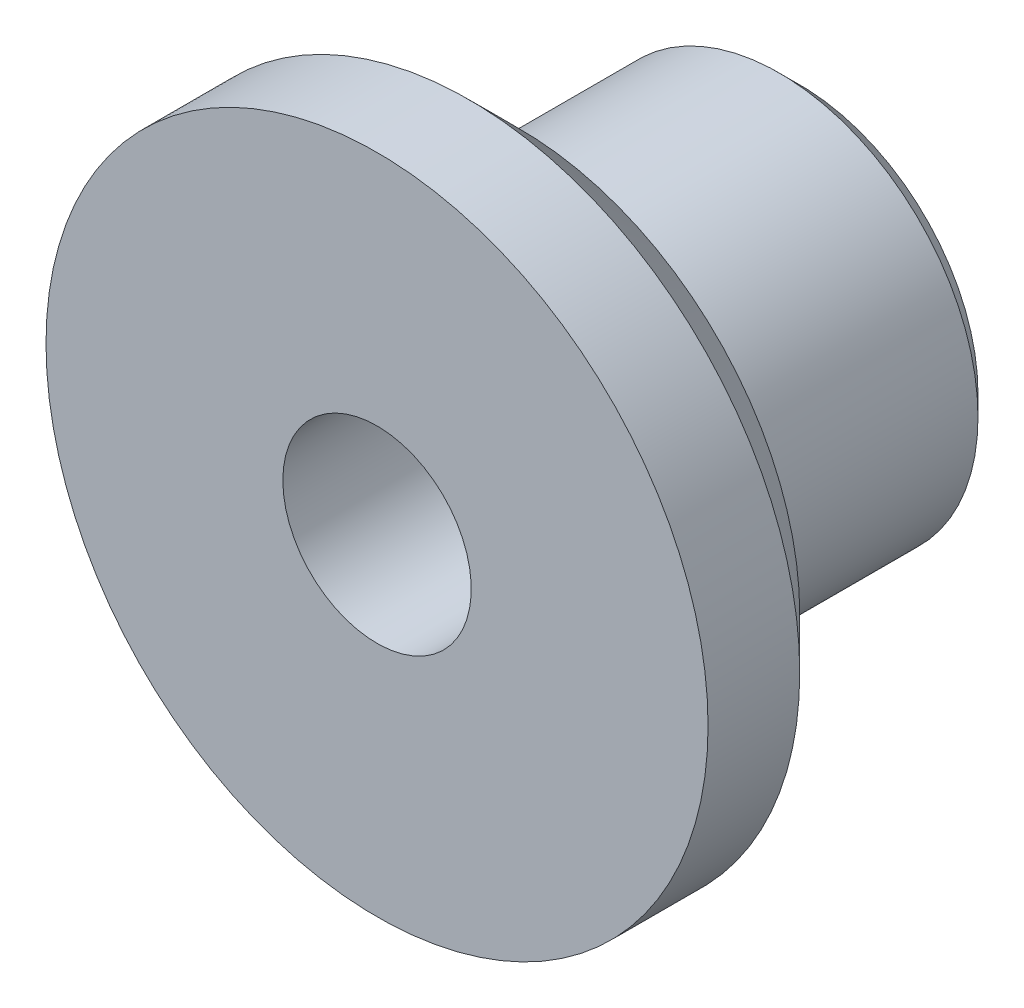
ISO-10303-21;
HEADER;
FILE_DESCRIPTION(('STEP AP214'),'2;1');
FILE_NAME('part.step','',(''),(''),'','','');
FILE_SCHEMA(('AUTOMOTIVE_DESIGN { 1 0 10303 214 1 1 1 1 }'));
ENDSEC;
DATA;
#1=APPLICATION_CONTEXT('core data for automotive mechanical design processes');
#2=APPLICATION_PROTOCOL_DEFINITION('international standard','automotive_design',2000,#1);
#3=PRODUCT_CONTEXT('',#1,'mechanical');
#4=PRODUCT('Part','Part','',(#3));
#5=PRODUCT_RELATED_PRODUCT_CATEGORY('part','',(#4));
#6=PRODUCT_DEFINITION_FORMATION('','',#4);
#7=PRODUCT_DEFINITION_CONTEXT('part definition',#1,'design');
#8=PRODUCT_DEFINITION('design','',#6,#7);
#9=PRODUCT_DEFINITION_SHAPE('','',#8);
#10=(LENGTH_UNIT() NAMED_UNIT(*) SI_UNIT(.MILLI.,.METRE.));
#11=(NAMED_UNIT(*) PLANE_ANGLE_UNIT() SI_UNIT($,.RADIAN.));
#12=(NAMED_UNIT(*) SI_UNIT($,.STERADIAN.) SOLID_ANGLE_UNIT());
#13=UNCERTAINTY_MEASURE_WITH_UNIT(LENGTH_MEASURE(1.E-05),#10,'distance_accuracy_value','');
#14=(GEOMETRIC_REPRESENTATION_CONTEXT(3) GLOBAL_UNCERTAINTY_ASSIGNED_CONTEXT((#13)) GLOBAL_UNIT_ASSIGNED_CONTEXT((#10,
#11,#12)) REPRESENTATION_CONTEXT('',''));
#15=CARTESIAN_POINT('',(0.,0.,0.));
#16=DIRECTION('',(0.,0.,1.));
#17=DIRECTION('',(1.,0.,0.));
#18=AXIS2_PLACEMENT_3D('',#15,#16,#17);
#19=CARTESIAN_POINT('',(0.,0.,8.3));
#20=DIRECTION('',(0.,0.,-1.));
#21=DIRECTION('',(-1.,0.,0.));
#22=AXIS2_PLACEMENT_3D('',#19,#20,#21);
#23=CYLINDRICAL_SURFACE('',#22,3.9);
#24=CARTESIAN_POINT('',(0.,0.,5.30000000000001));
#25=DIRECTION('',(0.,0.,1.));
#26=DIRECTION('',(1.,0.,0.));
#27=AXIS2_PLACEMENT_3D('',#24,#25,#26);
#28=CIRCLE('',#27,3.9);
#29=CARTESIAN_POINT('',(-3.9,0.,5.30000000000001));
#30=VERTEX_POINT('',#29);
#31=EDGE_CURVE('E11',#30,#30,#28,.F.);
#32=CARTESIAN_POINT('',(0.,0.,0.400000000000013));
#33=DIRECTION('',(0.,0.,1.));
#34=DIRECTION('',(1.,0.,0.));
#35=AXIS2_PLACEMENT_3D('',#32,#33,#34);
#36=CIRCLE('',#35,3.9);
#37=CARTESIAN_POINT('',(-3.9,0.,0.400000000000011));
#38=VERTEX_POINT('',#37);
#39=EDGE_CURVE('E56',#38,#38,#36,.T.);
#40=CARTESIAN_POINT('',(-3.9,0.,5.30000000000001));
#41=CARTESIAN_POINT('',(-3.9,0.,5.24895833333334));
#42=CARTESIAN_POINT('',(-3.9,0.,5.19791666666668));
#43=CARTESIAN_POINT('',(-3.9,0.,5.09583333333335));
#44=CARTESIAN_POINT('',(-3.9,0.,5.04479166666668));
#45=CARTESIAN_POINT('',(-3.9,0.,4.94270833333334));
#46=CARTESIAN_POINT('',(-3.9,0.,4.89166666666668));
#47=CARTESIAN_POINT('',(-3.9,0.,4.78958333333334));
#48=CARTESIAN_POINT('',(-3.9,0.,4.73854166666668));
#49=CARTESIAN_POINT('',(-3.9,0.,4.63645833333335));
#50=CARTESIAN_POINT('',(-3.9,0.,4.58541666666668));
#51=CARTESIAN_POINT('',(-3.9,0.,4.48333333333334));
#52=CARTESIAN_POINT('',(-3.9,0.,4.43229166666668));
#53=CARTESIAN_POINT('',(-3.9,0.,4.33020833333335));
#54=CARTESIAN_POINT('',(-3.9,0.,4.27916666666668));
#55=CARTESIAN_POINT('',(-3.9,0.,4.17708333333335));
#56=CARTESIAN_POINT('',(-3.9,0.,4.12604166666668));
#57=CARTESIAN_POINT('',(-3.9,0.,4.02395833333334));
#58=CARTESIAN_POINT('',(-3.9,0.,3.97291666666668));
#59=CARTESIAN_POINT('',(-3.9,0.,3.87083333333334));
#60=CARTESIAN_POINT('',(-3.9,0.,3.81979166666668));
#61=CARTESIAN_POINT('',(-3.9,0.,3.71770833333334));
#62=CARTESIAN_POINT('',(-3.9,0.,3.66666666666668));
#63=CARTESIAN_POINT('',(-3.9,0.,3.56458333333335));
#64=CARTESIAN_POINT('',(-3.9,0.,3.51354166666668));
#65=CARTESIAN_POINT('',(-3.9,0.,3.41145833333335));
#66=CARTESIAN_POINT('',(-3.9,0.,3.36041666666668));
#67=CARTESIAN_POINT('',(-3.9,0.,3.25833333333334));
#68=CARTESIAN_POINT('',(-3.9,0.,3.20729166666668));
#69=CARTESIAN_POINT('',(-3.9,0.,3.10520833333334));
#70=CARTESIAN_POINT('',(-3.9,0.,3.05416666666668));
#71=CARTESIAN_POINT('',(-3.9,0.,2.95208333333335));
#72=CARTESIAN_POINT('',(-3.9,0.,2.90104166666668));
#73=CARTESIAN_POINT('',(-3.9,0.,2.79895833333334));
#74=CARTESIAN_POINT('',(-3.9,0.,2.74791666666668));
#75=CARTESIAN_POINT('',(-3.9,0.,2.64583333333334));
#76=CARTESIAN_POINT('',(-3.9,0.,2.59479166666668));
#77=CARTESIAN_POINT('',(-3.9,0.,2.49270833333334));
#78=CARTESIAN_POINT('',(-3.9,0.,2.44166666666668));
#79=CARTESIAN_POINT('',(-3.9,0.,2.33958333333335));
#80=CARTESIAN_POINT('',(-3.9,0.,2.28854166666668));
#81=CARTESIAN_POINT('',(-3.9,0.,2.18645833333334));
#82=CARTESIAN_POINT('',(-3.9,0.,2.13541666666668));
#83=CARTESIAN_POINT('',(-3.9,0.,2.03333333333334));
#84=CARTESIAN_POINT('',(-3.9,0.,1.98229166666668));
#85=CARTESIAN_POINT('',(-3.9,0.,1.88020833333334));
#86=CARTESIAN_POINT('',(-3.9,0.,1.82916666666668));
#87=CARTESIAN_POINT('',(-3.9,0.,1.72708333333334));
#88=CARTESIAN_POINT('',(-3.9,0.,1.67604166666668));
#89=CARTESIAN_POINT('',(-3.9,0.,1.57395833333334));
#90=CARTESIAN_POINT('',(-3.9,0.,1.52291666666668));
#91=CARTESIAN_POINT('',(-3.9,0.,1.42083333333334));
#92=CARTESIAN_POINT('',(-3.9,0.,1.36979166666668));
#93=CARTESIAN_POINT('',(-3.9,0.,1.26770833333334));
#94=CARTESIAN_POINT('',(-3.9,0.,1.21666666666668));
#95=CARTESIAN_POINT('',(-3.9,0.,1.11458333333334));
#96=CARTESIAN_POINT('',(-3.9,0.,1.06354166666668));
#97=CARTESIAN_POINT('',(-3.9,0.,0.961458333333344));
#98=CARTESIAN_POINT('',(-3.9,0.,0.910416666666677));
#99=CARTESIAN_POINT('',(-3.9,0.,0.808333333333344));
#100=CARTESIAN_POINT('',(-3.9,0.,0.757291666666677));
#101=CARTESIAN_POINT('',(-3.9,0.,0.655208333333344));
#102=CARTESIAN_POINT('',(-3.9,0.,0.604166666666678));
#103=CARTESIAN_POINT('',(-3.9,0.,0.502083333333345));
#104=CARTESIAN_POINT('',(-3.9,0.,0.451041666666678));
#105=CARTESIAN_POINT('',(-3.9,0.,0.400000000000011));
#106=B_SPLINE_CURVE_WITH_KNOTS('',3,(#40,#41,#42,#43,#44,#45,#46,#47,#48,#49,#50,#51,#52,#53,
#54,#55,#56,#57,#58,#59,#60,#61,#62,#63,#64,#65,#66,#67,#68,#69,#70,#71,#72,#73,#74,#75,#76,#77,
#78,#79,#80,#81,#82,#83,#84,#85,#86,#87,#88,#89,#90,#91,#92,#93,#94,#95,#96,#97,#98,#99,#100,
#101,#102,#103,#104,#105),.UNSPECIFIED.,.F.,.F.,(4,2,2,2,2,2,2,2,2,2,2,2,2,2,2,2,2,2,2,2,2,2,2,
2,2,2,2,2,2,2,2,2,4),(0.,0.153125,0.306249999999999,0.459375,0.6125,0.765625,0.918749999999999,
1.071875,1.225,1.378125,1.53125,1.684375,1.8375,1.990625,2.14375,2.296875,2.45,2.603125,2.75625,
2.909375,3.0625,3.215625,3.36875,3.521875,3.675,3.828125,3.98125,4.134375,4.2875,4.440625,
4.59375,4.746875,4.9),.UNSPECIFIED.);
#107=EDGE_CURVE('BSEAM33',#30,#38,#106,.T.);
#108=ORIENTED_EDGE('',*,*,#31,.T.);
#109=ORIENTED_EDGE('',*,*,#39,.T.);
#110=ORIENTED_EDGE('',*,*,#107,.T.);
#111=ORIENTED_EDGE('',*,*,#107,.F.);
#112=EDGE_LOOP('',(#108,#110,#109,#111));
#113=FACE_BOUND('',#112,.T.);
#114=ADVANCED_FACE('F33',(#113),#23,.T.);
#115=CARTESIAN_POINT('',(0.,0.,8.3));
#116=DIRECTION('',(0.,0.,-1.));
#117=DIRECTION('',(-1.,0.,0.));
#118=AXIS2_PLACEMENT_3D('',#115,#116,#117);
#119=CYLINDRICAL_SURFACE('',#118,1.85);
#120=CARTESIAN_POINT('',(0.,0.,0.400000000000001));
#121=DIRECTION('',(0.,0.,1.));
#122=DIRECTION('',(1.,0.,0.));
#123=AXIS2_PLACEMENT_3D('',#120,#121,#122);
#124=CIRCLE('',#123,1.85);
#125=CARTESIAN_POINT('',(-1.85,0.,0.400000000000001));
#126=VERTEX_POINT('',#125);
#127=EDGE_CURVE('E44',#126,#126,#124,.F.);
#128=CARTESIAN_POINT('',(0.,0.,8.3));
#129=DIRECTION('',(0.,0.,1.));
#130=DIRECTION('',(1.,0.,0.));
#131=AXIS2_PLACEMENT_3D('',#128,#129,#130);
#132=CIRCLE('',#131,1.85);
#133=CARTESIAN_POINT('',(-1.85,0.,8.3));
#134=VERTEX_POINT('',#133);
#135=EDGE_CURVE('E68',#134,#134,#132,.T.);
#136=CARTESIAN_POINT('',(-1.85,0.,0.400000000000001));
#137=CARTESIAN_POINT('',(-1.85,0.,0.482291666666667));
#138=CARTESIAN_POINT('',(-1.85,0.,0.564583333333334));
#139=CARTESIAN_POINT('',(-1.85,0.,0.729166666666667));
#140=CARTESIAN_POINT('',(-1.85,0.,0.811458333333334));
#141=CARTESIAN_POINT('',(-1.85,0.,0.976041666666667));
#142=CARTESIAN_POINT('',(-1.85,0.,1.05833333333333));
#143=CARTESIAN_POINT('',(-1.85,0.,1.22291666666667));
#144=CARTESIAN_POINT('',(-1.85,0.,1.30520833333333));
#145=CARTESIAN_POINT('',(-1.85,0.,1.46979166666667));
#146=CARTESIAN_POINT('',(-1.85,0.,1.55208333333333));
#147=CARTESIAN_POINT('',(-1.85,0.,1.71666666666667));
#148=CARTESIAN_POINT('',(-1.85,0.,1.79895833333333));
#149=CARTESIAN_POINT('',(-1.85,0.,1.96354166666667));
#150=CARTESIAN_POINT('',(-1.85,0.,2.04583333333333));
#151=CARTESIAN_POINT('',(-1.85,0.,2.21041666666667));
#152=CARTESIAN_POINT('',(-1.85,0.,2.29270833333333));
#153=CARTESIAN_POINT('',(-1.85,0.,2.45729166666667));
#154=CARTESIAN_POINT('',(-1.85,0.,2.53958333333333));
#155=CARTESIAN_POINT('',(-1.85,0.,2.70416666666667));
#156=CARTESIAN_POINT('',(-1.85,0.,2.78645833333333));
#157=CARTESIAN_POINT('',(-1.85,0.,2.95104166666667));
#158=CARTESIAN_POINT('',(-1.85,0.,3.03333333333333));
#159=CARTESIAN_POINT('',(-1.85,0.,3.19791666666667));
#160=CARTESIAN_POINT('',(-1.85,0.,3.28020833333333));
#161=CARTESIAN_POINT('',(-1.85,0.,3.44479166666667));
#162=CARTESIAN_POINT('',(-1.85,0.,3.52708333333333));
#163=CARTESIAN_POINT('',(-1.85,0.,3.69166666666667));
#164=CARTESIAN_POINT('',(-1.85,0.,3.77395833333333));
#165=CARTESIAN_POINT('',(-1.85,0.,3.93854166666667));
#166=CARTESIAN_POINT('',(-1.85,0.,4.02083333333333));
#167=CARTESIAN_POINT('',(-1.85,0.,4.18541666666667));
#168=CARTESIAN_POINT('',(-1.85,0.,4.26770833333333));
#169=CARTESIAN_POINT('',(-1.85,0.,4.43229166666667));
#170=CARTESIAN_POINT('',(-1.85,0.,4.51458333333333));
#171=CARTESIAN_POINT('',(-1.85,0.,4.67916666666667));
#172=CARTESIAN_POINT('',(-1.85,0.,4.76145833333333));
#173=CARTESIAN_POINT('',(-1.85,0.,4.92604166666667));
#174=CARTESIAN_POINT('',(-1.85,0.,5.00833333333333));
#175=CARTESIAN_POINT('',(-1.85,0.,5.17291666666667));
#176=CARTESIAN_POINT('',(-1.85,0.,5.25520833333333));
#177=CARTESIAN_POINT('',(-1.85,0.,5.41979166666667));
#178=CARTESIAN_POINT('',(-1.85,0.,5.50208333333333));
#179=CARTESIAN_POINT('',(-1.85,0.,5.66666666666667));
#180=CARTESIAN_POINT('',(-1.85,0.,5.74895833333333));
#181=CARTESIAN_POINT('',(-1.85,0.,5.91354166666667));
#182=CARTESIAN_POINT('',(-1.85,0.,5.99583333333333));
#183=CARTESIAN_POINT('',(-1.85,0.,6.16041666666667));
#184=CARTESIAN_POINT('',(-1.85,0.,6.24270833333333));
#185=CARTESIAN_POINT('',(-1.85,0.,6.40729166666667));
#186=CARTESIAN_POINT('',(-1.85,0.,6.48958333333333));
#187=CARTESIAN_POINT('',(-1.85,0.,6.65416666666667));
#188=CARTESIAN_POINT('',(-1.85,0.,6.73645833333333));
#189=CARTESIAN_POINT('',(-1.85,0.,6.90104166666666));
#190=CARTESIAN_POINT('',(-1.85,0.,6.98333333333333));
#191=CARTESIAN_POINT('',(-1.85,0.,7.14791666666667));
#192=CARTESIAN_POINT('',(-1.85,0.,7.23020833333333));
#193=CARTESIAN_POINT('',(-1.85,0.,7.39479166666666));
#194=CARTESIAN_POINT('',(-1.85,0.,7.47708333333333));
#195=CARTESIAN_POINT('',(-1.85,0.,7.64166666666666));
#196=CARTESIAN_POINT('',(-1.85,0.,7.72395833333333));
#197=CARTESIAN_POINT('',(-1.85,0.,7.88854166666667));
#198=CARTESIAN_POINT('',(-1.85,0.,7.97083333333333));
#199=CARTESIAN_POINT('',(-1.85,0.,8.13541666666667));
#200=CARTESIAN_POINT('',(-1.85,0.,8.21770833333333));
#201=CARTESIAN_POINT('',(-1.85,0.,8.3));
#202=B_SPLINE_CURVE_WITH_KNOTS('',3,(#136,#137,#138,#139,#140,#141,#142,#143,#144,#145,#146,
#147,#148,#149,#150,#151,#152,#153,#154,#155,#156,#157,#158,#159,#160,#161,#162,#163,#164,#165,
#166,#167,#168,#169,#170,#171,#172,#173,#174,#175,#176,#177,#178,#179,#180,#181,#182,#183,#184,
#185,#186,#187,#188,#189,#190,#191,#192,#193,#194,#195,#196,#197,#198,#199,#200,#201),
.UNSPECIFIED.,.F.,.F.,(4,2,2,2,2,2,2,2,2,2,2,2,2,2,2,2,2,2,2,2,2,2,2,2,2,2,2,2,2,2,2,2,4),(0.,
0.246874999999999,0.493749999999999,0.740624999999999,0.987499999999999,1.234375,1.48125,
1.728125,1.975,2.221875,2.46875,2.715625,2.9625,3.209375,3.45625,3.703125,3.95,4.196875,4.44375,
4.690625,4.9375,5.184375,5.43125,5.678125,5.925,6.171875,6.41875,6.665625,6.9125,7.159375,
7.40625,7.653125,7.9),.UNSPECIFIED.);
#203=EDGE_CURVE('BSEAM72',#126,#134,#202,.T.);
#204=ORIENTED_EDGE('',*,*,#127,.T.);
#205=ORIENTED_EDGE('',*,*,#135,.T.);
#206=ORIENTED_EDGE('',*,*,#203,.T.);
#207=ORIENTED_EDGE('',*,*,#203,.F.);
#208=EDGE_LOOP('',(#204,#206,#205,#207));
#209=FACE_BOUND('',#208,.T.);
#210=ADVANCED_FACE('F72',(#209),#119,.F.);
#211=CARTESIAN_POINT('',(0.,0.,0.));
#212=DIRECTION('',(0.,0.,1.));
#213=DIRECTION('',(1.,0.,0.));
#214=AXIS2_PLACEMENT_3D('',#211,#212,#213);
#215=PLANE('',#214);
#216=CARTESIAN_POINT('',(0.,0.,0.));
#217=DIRECTION('',(0.,0.,1.));
#218=DIRECTION('',(1.,0.,0.));
#219=AXIS2_PLACEMENT_3D('',#216,#217,#218);
#220=CIRCLE('',#219,3.49999999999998);
#221=CARTESIAN_POINT('',(3.49999999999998,0.,0.));
#222=VERTEX_POINT('',#221);
#223=EDGE_CURVE('E48',#222,#222,#220,.F.);
#224=ORIENTED_EDGE('',*,*,#223,.T.);
#225=EDGE_LOOP('',(#224));
#226=FACE_BOUND('',#225,.T.);
#227=CARTESIAN_POINT('',(0.,0.,0.));
#228=DIRECTION('',(0.,0.,1.));
#229=DIRECTION('',(1.,0.,0.));
#230=AXIS2_PLACEMENT_3D('',#227,#228,#229);
#231=CIRCLE('',#230,2.25);
#232=CARTESIAN_POINT('',(-2.25,0.,0.));
#233=VERTEX_POINT('',#232);
#234=EDGE_CURVE('E53',#233,#233,#231,.T.);
#235=ORIENTED_EDGE('',*,*,#234,.T.);
#236=EDGE_LOOP('',(#235));
#237=FACE_BOUND('',#236,.T.);
#238=ADVANCED_FACE('F89',(#226,#237),#215,.F.);
#239=CARTESIAN_POINT('',(0.,0.,5.5));
#240=DIRECTION('',(0.,0.,1.));
#241=DIRECTION('',(1.,0.,0.));
#242=AXIS2_PLACEMENT_3D('',#239,#240,#241);
#243=PLANE('',#242);
#244=CARTESIAN_POINT('',(0.,0.,5.5));
#245=DIRECTION('',(0.,0.,1.));
#246=DIRECTION('',(1.,0.,0.));
#247=AXIS2_PLACEMENT_3D('',#244,#245,#246);
#248=CIRCLE('',#247,4.09999999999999);
#249=CARTESIAN_POINT('',(4.09999999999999,0.,5.5));
#250=VERTEX_POINT('',#249);
#251=EDGE_CURVE('E40',#250,#250,#248,.T.);
#252=ORIENTED_EDGE('',*,*,#251,.T.);
#253=EDGE_LOOP('',(#252));
#254=FACE_BOUND('',#253,.T.);
#255=CARTESIAN_POINT('',(0.,0.,5.5));
#256=DIRECTION('',(0.,0.,1.));
#257=DIRECTION('',(1.,0.,0.));
#258=AXIS2_PLACEMENT_3D('',#255,#256,#257);
#259=CIRCLE('',#258,5.50000000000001);
#260=CARTESIAN_POINT('',(5.50000000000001,0.,5.5));
#261=VERTEX_POINT('',#260);
#262=EDGE_CURVE('E62',#261,#261,#259,.F.);
#263=ORIENTED_EDGE('',*,*,#262,.T.);
#264=EDGE_LOOP('',(#263));
#265=FACE_BOUND('',#264,.T.);
#266=ADVANCED_FACE('F83',(#254,#265),#243,.F.);
#267=CARTESIAN_POINT('',(0.,0.,-18.3847763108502));
#268=DIRECTION('',(0.,0.,1.));
#269=DIRECTION('',(1.,0.,0.));
#270=AXIS2_PLACEMENT_3D('',#267,#268,#269);
#271=CYLINDRICAL_SURFACE('',#270,6.5);
#272=CARTESIAN_POINT('',(0.,0.,6.5));
#273=DIRECTION('',(0.,0.,1.));
#274=DIRECTION('',(1.,0.,0.));
#275=AXIS2_PLACEMENT_3D('',#272,#273,#274);
#276=CIRCLE('',#275,6.5);
#277=CARTESIAN_POINT('',(6.5,0.,6.5));
#278=VERTEX_POINT('',#277);
#279=EDGE_CURVE('E59',#278,#278,#276,.T.);
#280=ORIENTED_EDGE('',*,*,#279,.T.);
#281=EDGE_LOOP('',(#280));
#282=FACE_BOUND('',#281,.T.);
#283=CARTESIAN_POINT('',(0.,0.,8.3));
#284=DIRECTION('',(0.,0.,1.));
#285=DIRECTION('',(1.,0.,0.));
#286=AXIS2_PLACEMENT_3D('',#283,#284,#285);
#287=CIRCLE('',#286,6.5);
#288=CARTESIAN_POINT('',(6.5,0.,8.3));
#289=VERTEX_POINT('',#288);
#290=EDGE_CURVE('E65',#289,#289,#287,.T.);
#291=ORIENTED_EDGE('',*,*,#290,.F.);
#292=EDGE_LOOP('',(#291));
#293=FACE_BOUND('',#292,.T.);
#294=ADVANCED_FACE('F78',(#282,#293),#271,.T.);
#295=CARTESIAN_POINT('',(0.,0.,8.3));
#296=DIRECTION('',(0.,0.,1.));
#297=DIRECTION('',(1.,0.,0.));
#298=AXIS2_PLACEMENT_3D('',#295,#296,#297);
#299=PLANE('',#298);
#300=ORIENTED_EDGE('',*,*,#135,.F.);
#301=EDGE_LOOP('',(#300));
#302=FACE_BOUND('',#301,.T.);
#303=ORIENTED_EDGE('',*,*,#290,.T.);
#304=EDGE_LOOP('',(#303));
#305=FACE_BOUND('',#304,.T.);
#306=ADVANCED_FACE('F74',(#302,#305),#299,.T.);
#307=CARTESIAN_POINT('',(0.,0.,5.5));
#308=DIRECTION('',(0.,0.,1.));
#309=DIRECTION('',(1.,0.,0.));
#310=AXIS2_PLACEMENT_3D('',#307,#308,#309);
#311=CONICAL_SURFACE('',#310,5.50000000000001,0.785398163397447);
#312=ORIENTED_EDGE('',*,*,#279,.F.);
#313=EDGE_LOOP('',(#312));
#314=FACE_BOUND('',#313,.T.);
#315=ORIENTED_EDGE('',*,*,#262,.F.);
#316=EDGE_LOOP('',(#315));
#317=FACE_BOUND('',#316,.T.);
#318=ADVANCED_FACE('F77',(#314,#317),#311,.T.);
#319=CARTESIAN_POINT('',(0.,0.,0.400000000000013));
#320=DIRECTION('',(0.,0.,1.));
#321=DIRECTION('',(1.,0.,0.));
#322=AXIS2_PLACEMENT_3D('',#319,#320,#321);
#323=CONICAL_SURFACE('',#322,3.9,0.78539816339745);
#324=ORIENTED_EDGE('',*,*,#223,.F.);
#325=EDGE_LOOP('',(#324));
#326=FACE_BOUND('',#325,.T.);
#327=ORIENTED_EDGE('',*,*,#39,.F.);
#328=EDGE_LOOP('',(#327));
#329=FACE_BOUND('',#328,.T.);
#330=ADVANCED_FACE('F103',(#326,#329),#323,.T.);
#331=CARTESIAN_POINT('',(0.,0.,0.));
#332=DIRECTION('',(0.,0.,-1.));
#333=DIRECTION('',(-1.,0.,0.));
#334=AXIS2_PLACEMENT_3D('',#331,#332,#333);
#335=CONICAL_SURFACE('',#334,2.25,0.785398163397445);
#336=CARTESIAN_POINT('',(-1.85,0.,0.400000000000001));
#337=CARTESIAN_POINT('',(-1.85416666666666,0.,0.395833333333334));
#338=CARTESIAN_POINT('',(-1.85833333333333,0.,0.391666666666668));
#339=CARTESIAN_POINT('',(-1.86666666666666,0.,0.383333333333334));
#340=CARTESIAN_POINT('',(-1.87083333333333,0.,0.379166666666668));
#341=CARTESIAN_POINT('',(-1.87916666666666,0.,0.370833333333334));
#342=CARTESIAN_POINT('',(-1.88333333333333,0.,0.366666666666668));
#343=CARTESIAN_POINT('',(-1.89166666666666,0.,0.358333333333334));
#344=CARTESIAN_POINT('',(-1.89583333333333,0.,0.354166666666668));
#345=CARTESIAN_POINT('',(-1.90416666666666,0.,0.345833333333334));
#346=CARTESIAN_POINT('',(-1.90833333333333,0.,0.341666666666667));
#347=CARTESIAN_POINT('',(-1.91666666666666,0.,0.333333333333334));
#348=CARTESIAN_POINT('',(-1.92083333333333,0.,0.329166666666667));
#349=CARTESIAN_POINT('',(-1.92916666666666,0.,0.320833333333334));
#350=CARTESIAN_POINT('',(-1.93333333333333,0.,0.316666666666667));
#351=CARTESIAN_POINT('',(-1.94166666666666,0.,0.308333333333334));
#352=CARTESIAN_POINT('',(-1.94583333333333,0.,0.304166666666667));
#353=CARTESIAN_POINT('',(-1.95416666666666,0.,0.295833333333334));
#354=CARTESIAN_POINT('',(-1.95833333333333,0.,0.291666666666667));
#355=CARTESIAN_POINT('',(-1.96666666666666,0.,0.283333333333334));
#356=CARTESIAN_POINT('',(-1.97083333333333,0.,0.279166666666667));
#357=CARTESIAN_POINT('',(-1.97916666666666,0.,0.270833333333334));
#358=CARTESIAN_POINT('',(-1.98333333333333,0.,0.266666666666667));
#359=CARTESIAN_POINT('',(-1.99166666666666,0.,0.258333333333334));
#360=CARTESIAN_POINT('',(-1.99583333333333,0.,0.254166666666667));
#361=CARTESIAN_POINT('',(-2.00416666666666,0.,0.245833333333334));
#362=CARTESIAN_POINT('',(-2.00833333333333,0.,0.241666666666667));
#363=CARTESIAN_POINT('',(-2.01666666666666,0.,0.233333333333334));
#364=CARTESIAN_POINT('',(-2.02083333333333,0.,0.229166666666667));
#365=CARTESIAN_POINT('',(-2.02916666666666,0.,0.220833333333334));
#366=CARTESIAN_POINT('',(-2.03333333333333,0.,0.216666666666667));
#367=CARTESIAN_POINT('',(-2.04166666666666,0.,0.208333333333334));
#368=CARTESIAN_POINT('',(-2.04583333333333,0.,0.204166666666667));
#369=CARTESIAN_POINT('',(-2.05416666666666,0.,0.195833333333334));
#370=CARTESIAN_POINT('',(-2.05833333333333,0.,0.191666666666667));
#371=CARTESIAN_POINT('',(-2.06666666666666,0.,0.183333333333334));
#372=CARTESIAN_POINT('',(-2.07083333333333,0.,0.179166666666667));
#373=CARTESIAN_POINT('',(-2.07916666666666,0.,0.170833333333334));
#374=CARTESIAN_POINT('',(-2.08333333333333,0.,0.166666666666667));
#375=CARTESIAN_POINT('',(-2.09166666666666,0.,0.158333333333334));
#376=CARTESIAN_POINT('',(-2.09583333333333,0.,0.154166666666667));
#377=CARTESIAN_POINT('',(-2.10416666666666,0.,0.145833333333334));
#378=CARTESIAN_POINT('',(-2.10833333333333,0.,0.141666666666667));
#379=CARTESIAN_POINT('',(-2.11666666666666,0.,0.133333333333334));
#380=CARTESIAN_POINT('',(-2.12083333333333,0.,0.129166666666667));
#381=CARTESIAN_POINT('',(-2.12916666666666,0.,0.120833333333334));
#382=CARTESIAN_POINT('',(-2.13333333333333,0.,0.116666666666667));
#383=CARTESIAN_POINT('',(-2.14166666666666,0.,0.108333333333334));
#384=CARTESIAN_POINT('',(-2.14583333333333,0.,0.104166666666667));
#385=CARTESIAN_POINT('',(-2.15416666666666,0.,0.0958333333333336));
#386=CARTESIAN_POINT('',(-2.15833333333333,0.,0.0916666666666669));
#387=CARTESIAN_POINT('',(-2.16666666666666,0.,0.0833333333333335));
#388=CARTESIAN_POINT('',(-2.17083333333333,0.,0.0791666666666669));
#389=CARTESIAN_POINT('',(-2.17916666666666,0.,0.0708333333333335));
#390=CARTESIAN_POINT('',(-2.18333333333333,0.,0.0666666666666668));
#391=CARTESIAN_POINT('',(-2.19166666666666,0.,0.0583333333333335));
#392=CARTESIAN_POINT('',(-2.19583333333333,0.,0.0541666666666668));
#393=CARTESIAN_POINT('',(-2.20416666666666,0.,0.0458333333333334));
#394=CARTESIAN_POINT('',(-2.20833333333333,0.,0.0416666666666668));
#395=CARTESIAN_POINT('',(-2.21666666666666,0.,0.0333333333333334));
#396=CARTESIAN_POINT('',(-2.22083333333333,0.,0.0291666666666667));
#397=CARTESIAN_POINT('',(-2.22916666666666,0.,0.0208333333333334));
#398=CARTESIAN_POINT('',(-2.23333333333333,0.,0.0166666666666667));
#399=CARTESIAN_POINT('',(-2.24166666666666,0.,0.00833333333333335));
#400=CARTESIAN_POINT('',(-2.24583333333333,0.,0.00416666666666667));
#401=CARTESIAN_POINT('',(-2.25,0.,0.));
#402=B_SPLINE_CURVE_WITH_KNOTS('',3,(#336,#337,#338,#339,#340,#341,#342,#343,#344,#345,#346,
#347,#348,#349,#350,#351,#352,#353,#354,#355,#356,#357,#358,#359,#360,#361,#362,#363,#364,#365,
#366,#367,#368,#369,#370,#371,#372,#373,#374,#375,#376,#377,#378,#379,#380,#381,#382,#383,#384,
#385,#386,#387,#388,#389,#390,#391,#392,#393,#394,#395,#396,#397,#398,#399,#400,#401),
.UNSPECIFIED.,.F.,.F.,(4,2,2,2,2,2,2,2,2,2,2,2,2,2,2,2,2,2,2,2,2,2,2,2,2,2,2,2,2,2,2,2,4),(0.,
0.0176776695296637,0.0353553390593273,0.053033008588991,0.0707106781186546,0.0883883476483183,
0.106066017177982,0.123743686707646,0.141421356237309,0.159099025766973,0.176776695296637,
0.194454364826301,0.212132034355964,0.229809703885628,0.247487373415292,0.265165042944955,
0.282842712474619,0.300520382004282,0.318198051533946,0.33587572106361,0.353553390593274,
0.371231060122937,0.388908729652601,0.406586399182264,0.424264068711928,0.441941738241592,
0.459619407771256,0.477297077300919,0.494974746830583,0.512652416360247,0.53033008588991,
0.548007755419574,0.565685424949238),.UNSPECIFIED.);
#403=EDGE_CURVE('BSEAM106',#126,#233,#402,.T.);
#404=ORIENTED_EDGE('',*,*,#127,.F.);
#405=ORIENTED_EDGE('',*,*,#234,.F.);
#406=ORIENTED_EDGE('',*,*,#403,.T.);
#407=ORIENTED_EDGE('',*,*,#403,.F.);
#408=EDGE_LOOP('',(#404,#406,#405,#407));
#409=FACE_BOUND('',#408,.T.);
#410=ADVANCED_FACE('F106',(#409),#335,.F.);
#411=CARTESIAN_POINT('',(0.,0.,5.5));
#412=DIRECTION('',(0.,0.,1.));
#413=DIRECTION('',(1.,0.,0.));
#414=AXIS2_PLACEMENT_3D('',#411,#412,#413);
#415=CONICAL_SURFACE('',#414,4.09999999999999,0.785398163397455);
#416=ORIENTED_EDGE('',*,*,#31,.F.);
#417=EDGE_LOOP('',(#416));
#418=FACE_BOUND('',#417,.T.);
#419=ORIENTED_EDGE('',*,*,#251,.F.);
#420=EDGE_LOOP('',(#419));
#421=FACE_BOUND('',#420,.T.);
#422=ADVANCED_FACE('F35',(#418,#421),#415,.T.);
#423=CLOSED_SHELL('',(#114,#210,#238,#266,#294,#306,#318,#330,#410,#422));
#424=MANIFOLD_SOLID_BREP('B2',#423);
#425=ADVANCED_BREP_SHAPE_REPRESENTATION('',(#18,#424),#14);
#426=SHAPE_DEFINITION_REPRESENTATION(#9,#425);
ENDSEC;
END-ISO-10303-21;
